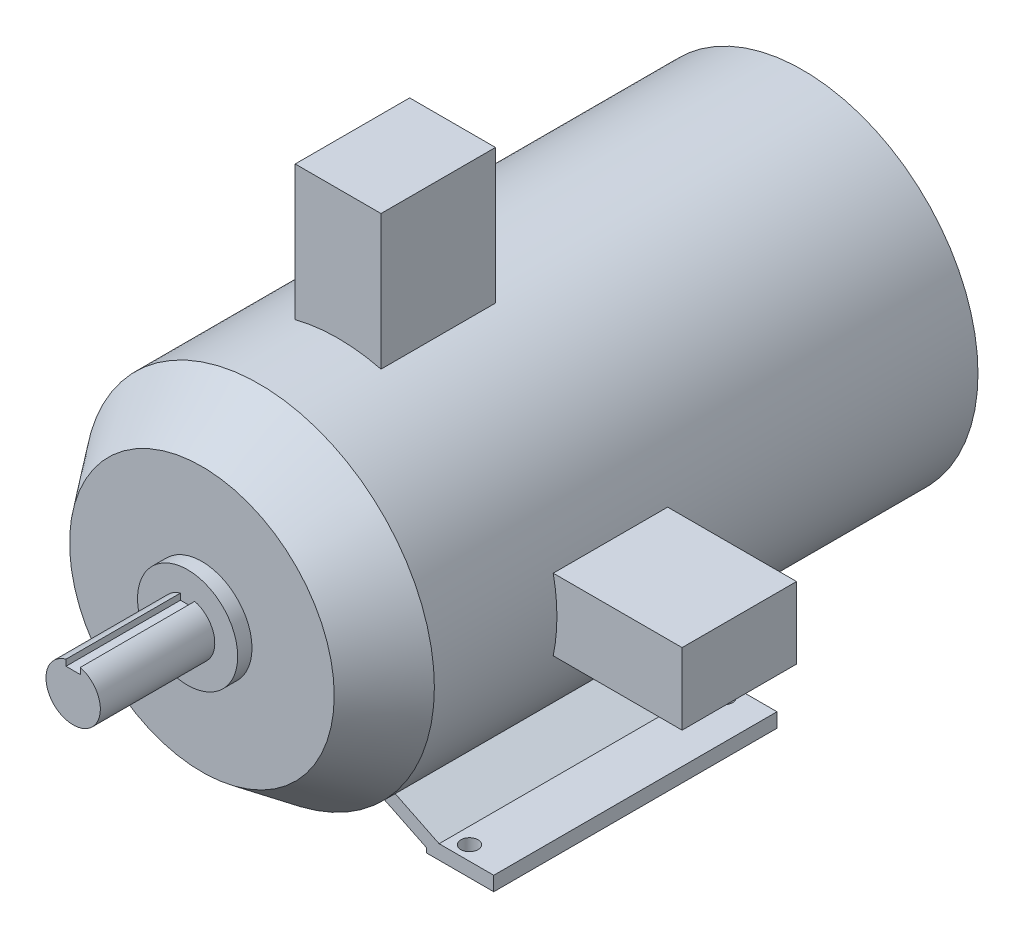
from build123d import *

# Parameters (mm, degrees)
SKETCH_1_R          = 122.5
EXTRUDE_1_DEPTH     = 420
SKETCH_2_R          = 35
EXTRUDE_2_DEPTH     = 10
SKETCH_3_R          = 19
EXTRUDE_3_DEPTH     = 80
CUT_EXTRUDE_START   = -80
CUT_EXTRUDE_1_DEPTH = 80
EXTRUDE_START       = -198
EXTRUDE_4_DEPTH     = 198
SKETCH_7_R          = 6
CUT_EXTRUDE_2_DEPTH = 10
SKETCH_8_W          = 80
SKETCH_8_H          = 50
EXTRUDE_5_DEPTH     = 210
SKETCH_9_W          = 60
SKETCH_9_H          = 80
EXTRUDE_6_DEPTH     = 213


with BuildPart() as part:
    # Sketch 1 → Extrude 1 (new body)
    with BuildSketch(Plane.XY):
        Circle(SKETCH_1_R)
    extrude(amount=EXTRUDE_1_DEPTH)

    # Sketch 2 → Extrude 2 (add)
    with BuildSketch(Plane.XY.offset(420)):
        Circle(SKETCH_2_R)
    extrude(amount=EXTRUDE_2_DEPTH)

    # Sketch 3 → Extrude 3 (add)
    with BuildSketch(Plane.XY.offset(430)):
        Circle(SKETCH_3_R)
    extrude(amount=EXTRUDE_3_DEPTH)

    # Sketch 4 → Cut-Revolve 1 (revolve, cut)
    with BuildSketch(Plane(origin=(0, 0, 0), x_dir=(1, 0, 0), z_dir=(0, 1, 0)), mode=Mode.PRIVATE) as cut_revolve_1_sk:
        Polygon((-122.5, -420), (-122.5, -380), (-92.5, -420), align=None)
    revolve(cut_revolve_1_sk.sketch.rotate(Axis((0, 0, 420), (0, 0, -1)), 180), axis=Axis((0, 0, 420), (0, 0, -1)), mode=Mode.SUBTRACT)

    # Sketch 5 → Cut-Extrude 1 (cut)
    with BuildSketch(Plane.XY.offset(510).offset(CUT_EXTRUDE_START)):
        with BuildLine():
            Line((-5, 18.33030278), (-5, 14))
            Line((-5, 14), (5, 14))
            Line((5, 14), (5, 18.33030278))
            ThreePointArc((5, 18.33030278), (0, 19), (-5, 18.33030278))
        make_face()
    extrude(amount=CUT_EXTRUDE_1_DEPTH, mode=Mode.SUBTRACT)

    # Sketch 6 → Extrude 4 (add)
    with BuildSketch(Plane.XY.offset(351).offset(EXTRUDE_START)):
        with BuildLine():
            Line((-135, -132), (-135, -122))
            Line((-135, -122), (-96.800252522, -122))
            Line((-96.800252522, -122), (-62.56469047, -105.318134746))
            ThreePointArc((-62.56469047, -105.318134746), (-57.156982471, -108.348185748), (-51.602920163, -111.100803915))
            Line((-51.602920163, -111.100803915), (-88, -128.835905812))
            Line((-88, -128.835905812), (-88, -132))
            Line((-88, -132), (-135, -132))
        make_face()
        with BuildLine():
            Line((88, -132), (88, -128.835905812))
            Line((88, -128.835905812), (51.602920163, -111.100803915))
            ThreePointArc((51.602920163, -111.100803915), (57.156982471, -108.348185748), (62.56469047, -105.318134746))
            Line((62.56469047, -105.318134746), (96.800252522, -122))
            Line((96.800252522, -122), (135, -122))
            Line((135, -122), (135, -132))
            Line((135, -132), (88, -132))
        make_face()
    extrude(amount=EXTRUDE_4_DEPTH)

    # Sketch 7 → Cut-Extrude 2 (cut)
    with BuildSketch(Plane.XZ.offset(132)):
        with Locations(Location((108, 341, 0), (0, 0, 270))):
            Circle(SKETCH_7_R)
        with Locations(Location((108, 163, 0), (0, 0, 270))):
            Circle(SKETCH_7_R)
        with Locations(Location((-108, 341, 0), (0, 0, 270))):
            Circle(SKETCH_7_R)
        with Locations(Location((-108, 163, 0), (0, 0, 270))):
            Circle(SKETCH_7_R)
    extrude(amount=-CUT_EXTRUDE_2_DEPTH, mode=Mode.SUBTRACT)

    # Sketch 8 → Extrude 5 (add)
    with BuildSketch(Plane(origin=(0, 0, 0), x_dir=(0, 0, -1), z_dir=(1, 0, 0))):
        with Locations((-254.347417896, 0)):
            Rectangle(SKETCH_8_W, SKETCH_8_H)
    extrude(amount=EXTRUDE_5_DEPTH)

    # Sketch 9 → Extrude 6 (add)
    with BuildSketch(Plane(origin=(0, 0, 0), x_dir=(1, 0, 0), z_dir=(0, 1, 0))):
        with Locations((0, -284.794007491)):
            Rectangle(SKETCH_9_W, SKETCH_9_H)
    extrude(amount=EXTRUDE_6_DEPTH)


solid = part.part
